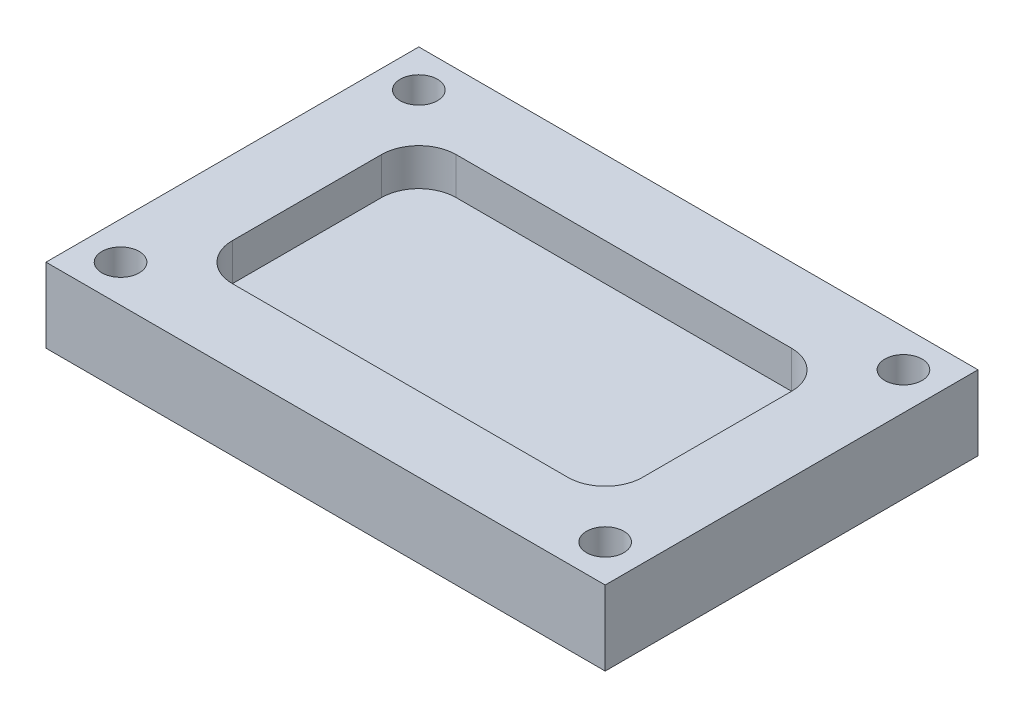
ISO-10303-21;
HEADER;
FILE_DESCRIPTION(('STEP AP214'),'2;1');
FILE_NAME('part.step','',(''),(''),'','','');
FILE_SCHEMA(('AUTOMOTIVE_DESIGN { 1 0 10303 214 1 1 1 1 }'));
ENDSEC;
DATA;
#1=APPLICATION_CONTEXT('core data for automotive mechanical design processes');
#2=APPLICATION_PROTOCOL_DEFINITION('international standard','automotive_design',2000,#1);
#3=PRODUCT_CONTEXT('',#1,'mechanical');
#4=PRODUCT('Part','Part','',(#3));
#5=PRODUCT_RELATED_PRODUCT_CATEGORY('part','',(#4));
#6=PRODUCT_DEFINITION_FORMATION('','',#4);
#7=PRODUCT_DEFINITION_CONTEXT('part definition',#1,'design');
#8=PRODUCT_DEFINITION('design','',#6,#7);
#9=PRODUCT_DEFINITION_SHAPE('','',#8);
#10=(LENGTH_UNIT() NAMED_UNIT(*) SI_UNIT(.MILLI.,.METRE.));
#11=(NAMED_UNIT(*) PLANE_ANGLE_UNIT() SI_UNIT($,.RADIAN.));
#12=(NAMED_UNIT(*) SI_UNIT($,.STERADIAN.) SOLID_ANGLE_UNIT());
#13=UNCERTAINTY_MEASURE_WITH_UNIT(LENGTH_MEASURE(1.E-05),#10,'distance_accuracy_value','');
#14=(GEOMETRIC_REPRESENTATION_CONTEXT(3) GLOBAL_UNCERTAINTY_ASSIGNED_CONTEXT((#13)) GLOBAL_UNIT_ASSIGNED_CONTEXT((#10,
#11,#12)) REPRESENTATION_CONTEXT('',''));
#15=CARTESIAN_POINT('',(0.,0.,0.));
#16=DIRECTION('',(0.,0.,1.));
#17=DIRECTION('',(1.,0.,0.));
#18=AXIS2_PLACEMENT_3D('',#15,#16,#17);
#19=CARTESIAN_POINT('',(75.,20.,50.));
#20=DIRECTION('',(-1.,0.,0.));
#21=DIRECTION('',(0.,0.,1.));
#22=AXIS2_PLACEMENT_3D('',#19,#20,#21);
#23=PLANE('',#22);
#24=DIRECTION('',(0.,0.,-1.));
#25=VECTOR('',#24,1.);
#26=CARTESIAN_POINT('',(75.,0.,50.));
#27=LINE('',#26,#25);
#28=CARTESIAN_POINT('',(75.,0.,50.));
#29=VERTEX_POINT('',#28);
#30=CARTESIAN_POINT('',(75.,0.,-50.));
#31=VERTEX_POINT('',#30);
#32=EDGE_CURVE('E300',#29,#31,#27,.T.);
#33=ORIENTED_EDGE('',*,*,#32,.T.);
#34=DIRECTION('',(0.,-1.,0.));
#35=VECTOR('',#34,1.);
#36=CARTESIAN_POINT('',(75.,20.,-50.));
#37=LINE('',#36,#35);
#38=CARTESIAN_POINT('',(75.,20.,-50.));
#39=VERTEX_POINT('',#38);
#40=EDGE_CURVE('E12',#39,#31,#37,.T.);
#41=ORIENTED_EDGE('',*,*,#40,.F.);
#42=DIRECTION('',(0.,0.,-1.));
#43=VECTOR('',#42,1.);
#44=CARTESIAN_POINT('',(75.,20.,50.));
#45=LINE('',#44,#43);
#46=CARTESIAN_POINT('',(75.,20.,50.));
#47=VERTEX_POINT('',#46);
#48=EDGE_CURVE('E304',#47,#39,#45,.T.);
#49=ORIENTED_EDGE('',*,*,#48,.F.);
#50=DIRECTION('',(0.,-1.,0.));
#51=VECTOR('',#50,1.);
#52=CARTESIAN_POINT('',(75.,20.,50.));
#53=LINE('',#52,#51);
#54=EDGE_CURVE('E322',#47,#29,#53,.T.);
#55=ORIENTED_EDGE('',*,*,#54,.T.);
#56=EDGE_LOOP('',(#33,#41,#49,#55));
#57=FACE_BOUND('',#56,.T.);
#58=ADVANCED_FACE('F47',(#57),#23,.F.);
#59=CARTESIAN_POINT('',(-75.,20.,-50.));
#60=DIRECTION('',(0.,0.,1.));
#61=DIRECTION('',(1.,0.,0.));
#62=AXIS2_PLACEMENT_3D('',#59,#60,#61);
#63=PLANE('',#62);
#64=DIRECTION('',(-1.,0.,0.));
#65=VECTOR('',#64,1.);
#66=CARTESIAN_POINT('',(-75.,0.,-50.));
#67=LINE('',#66,#65);
#68=CARTESIAN_POINT('',(-75.,0.,-50.));
#69=VERTEX_POINT('',#68);
#70=EDGE_CURVE('E326',#31,#69,#67,.T.);
#71=ORIENTED_EDGE('',*,*,#70,.T.);
#72=DIRECTION('',(0.,-1.,0.));
#73=VECTOR('',#72,1.);
#74=CARTESIAN_POINT('',(-75.,20.,-50.));
#75=LINE('',#74,#73);
#76=CARTESIAN_POINT('',(-75.,20.,-50.));
#77=VERTEX_POINT('',#76);
#78=EDGE_CURVE('E55',#77,#69,#75,.T.);
#79=ORIENTED_EDGE('',*,*,#78,.F.);
#80=DIRECTION('',(-1.,0.,0.));
#81=VECTOR('',#80,1.);
#82=CARTESIAN_POINT('',(-75.,20.,-50.));
#83=LINE('',#82,#81);
#84=EDGE_CURVE('E99',#39,#77,#83,.T.);
#85=ORIENTED_EDGE('',*,*,#84,.F.);
#86=ORIENTED_EDGE('',*,*,#40,.T.);
#87=EDGE_LOOP('',(#71,#79,#85,#86));
#88=FACE_BOUND('',#87,.T.);
#89=ADVANCED_FACE('F361',(#88),#63,.F.);
#90=CARTESIAN_POINT('',(-75.,20.,50.));
#91=DIRECTION('',(1.,0.,0.));
#92=DIRECTION('',(0.,0.,-1.));
#93=AXIS2_PLACEMENT_3D('',#90,#91,#92);
#94=PLANE('',#93);
#95=DIRECTION('',(0.,0.,1.));
#96=VECTOR('',#95,1.);
#97=CARTESIAN_POINT('',(-75.,0.,50.));
#98=LINE('',#97,#96);
#99=CARTESIAN_POINT('',(-75.,0.,50.));
#100=VERTEX_POINT('',#99);
#101=EDGE_CURVE('E329',#69,#100,#98,.T.);
#102=ORIENTED_EDGE('',*,*,#101,.T.);
#103=DIRECTION('',(0.,-1.,0.));
#104=VECTOR('',#103,1.);
#105=CARTESIAN_POINT('',(-75.,20.,50.));
#106=LINE('',#105,#104);
#107=CARTESIAN_POINT('',(-75.,20.,50.));
#108=VERTEX_POINT('',#107);
#109=EDGE_CURVE('E336',#108,#100,#106,.T.);
#110=ORIENTED_EDGE('',*,*,#109,.F.);
#111=DIRECTION('',(0.,0.,1.));
#112=VECTOR('',#111,1.);
#113=CARTESIAN_POINT('',(-75.,20.,50.));
#114=LINE('',#113,#112);
#115=EDGE_CURVE('E316',#77,#108,#114,.T.);
#116=ORIENTED_EDGE('',*,*,#115,.F.);
#117=ORIENTED_EDGE('',*,*,#78,.T.);
#118=EDGE_LOOP('',(#102,#110,#116,#117));
#119=FACE_BOUND('',#118,.T.);
#120=ADVANCED_FACE('F343',(#119),#94,.F.);
#121=CARTESIAN_POINT('',(-75.,20.,50.));
#122=DIRECTION('',(0.,0.,-1.));
#123=DIRECTION('',(-1.,0.,0.));
#124=AXIS2_PLACEMENT_3D('',#121,#122,#123);
#125=PLANE('',#124);
#126=DIRECTION('',(1.,0.,0.));
#127=VECTOR('',#126,1.);
#128=CARTESIAN_POINT('',(-75.,0.,50.));
#129=LINE('',#128,#127);
#130=EDGE_CURVE('E92',#100,#29,#129,.T.);
#131=ORIENTED_EDGE('',*,*,#130,.T.);
#132=ORIENTED_EDGE('',*,*,#54,.F.);
#133=DIRECTION('',(1.,0.,0.));
#134=VECTOR('',#133,1.);
#135=CARTESIAN_POINT('',(-75.,20.,50.));
#136=LINE('',#135,#134);
#137=EDGE_CURVE('E71',#108,#47,#136,.T.);
#138=ORIENTED_EDGE('',*,*,#137,.F.);
#139=ORIENTED_EDGE('',*,*,#109,.T.);
#140=EDGE_LOOP('',(#131,#132,#138,#139));
#141=FACE_BOUND('',#140,.T.);
#142=ADVANCED_FACE('F351',(#141),#125,.F.);
#143=CARTESIAN_POINT('',(0.,20.,0.));
#144=DIRECTION('',(0.,-1.,0.));
#145=DIRECTION('',(0.,0.,-1.));
#146=AXIS2_PLACEMENT_3D('',#143,#144,#145);
#147=PLANE('',#146);
#148=DIRECTION('',(0.,0.,-1.));
#149=VECTOR('',#148,1.);
#150=CARTESIAN_POINT('',(55.,20.,19.9999999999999));
#151=LINE('',#150,#149);
#152=CARTESIAN_POINT('',(55.,20.,19.9999999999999));
#153=VERTEX_POINT('',#152);
#154=CARTESIAN_POINT('',(55.,20.,-19.9999999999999));
#155=VERTEX_POINT('',#154);
#156=EDGE_CURVE('E228',#153,#155,#151,.T.);
#157=ORIENTED_EDGE('',*,*,#156,.F.);
#158=CARTESIAN_POINT('',(45.,20.,20.));
#159=DIRECTION('',(0.,1.,0.));
#160=DIRECTION('',(0.,0.,-1.));
#161=AXIS2_PLACEMENT_3D('',#158,#159,#160);
#162=CIRCLE('',#161,10.);
#163=CARTESIAN_POINT('',(44.9999999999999,20.,30.));
#164=VERTEX_POINT('',#163);
#165=EDGE_CURVE('E62',#164,#153,#162,.T.);
#166=ORIENTED_EDGE('',*,*,#165,.F.);
#167=DIRECTION('',(1.,0.,0.));
#168=VECTOR('',#167,1.);
#169=CARTESIAN_POINT('',(-44.9999999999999,20.,30.));
#170=LINE('',#169,#168);
#171=CARTESIAN_POINT('',(-44.9999999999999,20.,30.));
#172=VERTEX_POINT('',#171);
#173=EDGE_CURVE('E182',#172,#164,#170,.T.);
#174=ORIENTED_EDGE('',*,*,#173,.F.);
#175=CARTESIAN_POINT('',(-45.,20.,20.));
#176=DIRECTION('',(0.,1.,0.));
#177=DIRECTION('',(0.,0.,-1.));
#178=AXIS2_PLACEMENT_3D('',#175,#176,#177);
#179=CIRCLE('',#178,10.);
#180=CARTESIAN_POINT('',(-55.,20.,19.9999999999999));
#181=VERTEX_POINT('',#180);
#182=EDGE_CURVE('E186',#181,#172,#179,.T.);
#183=ORIENTED_EDGE('',*,*,#182,.F.);
#184=DIRECTION('',(0.,0.,1.));
#185=VECTOR('',#184,1.);
#186=CARTESIAN_POINT('',(-55.,20.,-19.9999999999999));
#187=LINE('',#186,#185);
#188=CARTESIAN_POINT('',(-55.,20.,-19.9999999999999));
#189=VERTEX_POINT('',#188);
#190=EDGE_CURVE('E245',#189,#181,#187,.T.);
#191=ORIENTED_EDGE('',*,*,#190,.F.);
#192=CARTESIAN_POINT('',(-45.,20.,-20.));
#193=DIRECTION('',(0.,1.,0.));
#194=DIRECTION('',(0.,0.,1.));
#195=AXIS2_PLACEMENT_3D('',#192,#193,#194);
#196=CIRCLE('',#195,10.);
#197=CARTESIAN_POINT('',(-44.9999999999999,20.,-30.));
#198=VERTEX_POINT('',#197);
#199=EDGE_CURVE('E239',#198,#189,#196,.T.);
#200=ORIENTED_EDGE('',*,*,#199,.F.);
#201=DIRECTION('',(-1.,0.,0.));
#202=VECTOR('',#201,1.);
#203=CARTESIAN_POINT('',(44.9999999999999,20.,-30.));
#204=LINE('',#203,#202);
#205=CARTESIAN_POINT('',(44.9999999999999,20.,-30.));
#206=VERTEX_POINT('',#205);
#207=EDGE_CURVE('E246',#206,#198,#204,.T.);
#208=ORIENTED_EDGE('',*,*,#207,.F.);
#209=CARTESIAN_POINT('',(45.,20.,-20.));
#210=DIRECTION('',(0.,1.,0.));
#211=DIRECTION('',(0.,0.,1.));
#212=AXIS2_PLACEMENT_3D('',#209,#210,#211);
#213=CIRCLE('',#212,10.);
#214=EDGE_CURVE('E625',#155,#206,#213,.T.);
#215=ORIENTED_EDGE('',*,*,#214,.F.);
#216=EDGE_LOOP('',(#157,#166,#174,#183,#191,#200,#208,#215));
#217=FACE_BOUND('',#216,.T.);
#218=CARTESIAN_POINT('',(-65.,20.,-40.));
#219=DIRECTION('',(0.,1.,0.));
#220=DIRECTION('',(0.,0.,1.));
#221=AXIS2_PLACEMENT_3D('',#218,#219,#220);
#222=CIRCLE('',#221,4.99999999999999);
#223=CARTESIAN_POINT('',(-65.,20.,-35.));
#224=VERTEX_POINT('',#223);
#225=EDGE_CURVE('E261',#224,#224,#222,.T.);
#226=ORIENTED_EDGE('',*,*,#225,.F.);
#227=EDGE_LOOP('',(#226));
#228=FACE_BOUND('',#227,.T.);
#229=CARTESIAN_POINT('',(-65.,20.,40.));
#230=DIRECTION('',(0.,1.,0.));
#231=DIRECTION('',(0.,0.,1.));
#232=AXIS2_PLACEMENT_3D('',#229,#230,#231);
#233=CIRCLE('',#232,4.99999999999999);
#234=CARTESIAN_POINT('',(-65.,20.,45.));
#235=VERTEX_POINT('',#234);
#236=EDGE_CURVE('E280',#235,#235,#233,.T.);
#237=ORIENTED_EDGE('',*,*,#236,.F.);
#238=EDGE_LOOP('',(#237));
#239=FACE_BOUND('',#238,.T.);
#240=CARTESIAN_POINT('',(65.,20.,40.));
#241=DIRECTION('',(0.,1.,0.));
#242=DIRECTION('',(0.,0.,1.));
#243=AXIS2_PLACEMENT_3D('',#240,#241,#242);
#244=CIRCLE('',#243,4.99999999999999);
#245=CARTESIAN_POINT('',(65.,20.,45.));
#246=VERTEX_POINT('',#245);
#247=EDGE_CURVE('E670',#246,#246,#244,.T.);
#248=ORIENTED_EDGE('',*,*,#247,.F.);
#249=EDGE_LOOP('',(#248));
#250=FACE_BOUND('',#249,.T.);
#251=CARTESIAN_POINT('',(65.,20.,-40.));
#252=DIRECTION('',(0.,1.,0.));
#253=DIRECTION('',(0.,0.,1.));
#254=AXIS2_PLACEMENT_3D('',#251,#252,#253);
#255=CIRCLE('',#254,4.99999999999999);
#256=CARTESIAN_POINT('',(65.,20.,-35.));
#257=VERTEX_POINT('',#256);
#258=EDGE_CURVE('E301',#257,#257,#255,.T.);
#259=ORIENTED_EDGE('',*,*,#258,.F.);
#260=EDGE_LOOP('',(#259));
#261=FACE_BOUND('',#260,.T.);
#262=ORIENTED_EDGE('',*,*,#48,.T.);
#263=ORIENTED_EDGE('',*,*,#84,.T.);
#264=ORIENTED_EDGE('',*,*,#115,.T.);
#265=ORIENTED_EDGE('',*,*,#137,.T.);
#266=EDGE_LOOP('',(#262,#263,#264,#265));
#267=FACE_BOUND('',#266,.T.);
#268=ADVANCED_FACE('F353',(#217,#228,#239,#250,#261,#267),#147,.F.);
#269=CARTESIAN_POINT('',(0.,0.,0.));
#270=DIRECTION('',(0.,-1.,0.));
#271=DIRECTION('',(0.,0.,-1.));
#272=AXIS2_PLACEMENT_3D('',#269,#270,#271);
#273=PLANE('',#272);
#274=ORIENTED_EDGE('',*,*,#32,.F.);
#275=ORIENTED_EDGE('',*,*,#130,.F.);
#276=ORIENTED_EDGE('',*,*,#101,.F.);
#277=ORIENTED_EDGE('',*,*,#70,.F.);
#278=EDGE_LOOP('',(#274,#275,#276,#277));
#279=FACE_BOUND('',#278,.T.);
#280=ADVANCED_FACE('F347',(#279),#273,.T.);
#281=CARTESIAN_POINT('',(65.,10.,-40.));
#282=DIRECTION('',(0.,1.,0.));
#283=DIRECTION('',(0.,0.,1.));
#284=AXIS2_PLACEMENT_3D('',#281,#282,#283);
#285=CONICAL_SURFACE('',#284,5.,1.02974425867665);
#286=CARTESIAN_POINT('',(65.,6.9956969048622,-40.));
#287=VERTEX_POINT('',#286);
#288=VERTEX_LOOP('',#287);
#289=FACE_BOUND('',#288,.T.);
#290=CARTESIAN_POINT('',(65.,10.,-40.));
#291=DIRECTION('',(0.,1.,0.));
#292=DIRECTION('',(0.,0.,1.));
#293=AXIS2_PLACEMENT_3D('',#290,#291,#292);
#294=CIRCLE('',#293,5.);
#295=CARTESIAN_POINT('',(65.,10.,-35.));
#296=VERTEX_POINT('',#295);
#297=EDGE_CURVE('E295',#296,#296,#294,.T.);
#298=ORIENTED_EDGE('',*,*,#297,.T.);
#299=EDGE_LOOP('',(#298));
#300=FACE_BOUND('',#299,.T.);
#301=ADVANCED_FACE('F393',(#289,#300),#285,.F.);
#302=CARTESIAN_POINT('',(65.,20.,-40.));
#303=DIRECTION('',(0.,1.,0.));
#304=DIRECTION('',(0.,0.,1.));
#305=AXIS2_PLACEMENT_3D('',#302,#303,#304);
#306=CYLINDRICAL_SURFACE('',#305,5.);
#307=ORIENTED_EDGE('',*,*,#297,.F.);
#308=EDGE_LOOP('',(#307));
#309=FACE_BOUND('',#308,.T.);
#310=ORIENTED_EDGE('',*,*,#258,.T.);
#311=EDGE_LOOP('',(#310));
#312=FACE_BOUND('',#311,.T.);
#313=ADVANCED_FACE('F400',(#309,#312),#306,.F.);
#314=CARTESIAN_POINT('',(65.,10.,40.));
#315=DIRECTION('',(0.,1.,0.));
#316=DIRECTION('',(0.,0.,1.));
#317=AXIS2_PLACEMENT_3D('',#314,#315,#316);
#318=CONICAL_SURFACE('',#317,5.,1.02974425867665);
#319=CARTESIAN_POINT('',(65.,6.9956969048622,40.));
#320=VERTEX_POINT('',#319);
#321=VERTEX_LOOP('',#320);
#322=FACE_BOUND('',#321,.T.);
#323=CARTESIAN_POINT('',(65.,10.,40.));
#324=DIRECTION('',(0.,1.,0.));
#325=DIRECTION('',(0.,0.,1.));
#326=AXIS2_PLACEMENT_3D('',#323,#324,#325);
#327=CIRCLE('',#326,5.);
#328=CARTESIAN_POINT('',(65.,10.,45.));
#329=VERTEX_POINT('',#328);
#330=EDGE_CURVE('E673',#329,#329,#327,.T.);
#331=ORIENTED_EDGE('',*,*,#330,.T.);
#332=EDGE_LOOP('',(#331));
#333=FACE_BOUND('',#332,.T.);
#334=ADVANCED_FACE('F409',(#322,#333),#318,.F.);
#335=CARTESIAN_POINT('',(65.,20.,40.));
#336=DIRECTION('',(0.,1.,0.));
#337=DIRECTION('',(0.,0.,1.));
#338=AXIS2_PLACEMENT_3D('',#335,#336,#337);
#339=CYLINDRICAL_SURFACE('',#338,5.);
#340=ORIENTED_EDGE('',*,*,#330,.F.);
#341=EDGE_LOOP('',(#340));
#342=FACE_BOUND('',#341,.T.);
#343=ORIENTED_EDGE('',*,*,#247,.T.);
#344=EDGE_LOOP('',(#343));
#345=FACE_BOUND('',#344,.T.);
#346=ADVANCED_FACE('F419',(#342,#345),#339,.F.);
#347=CARTESIAN_POINT('',(-65.,10.,40.));
#348=DIRECTION('',(0.,1.,0.));
#349=DIRECTION('',(0.,0.,1.));
#350=AXIS2_PLACEMENT_3D('',#347,#348,#349);
#351=CONICAL_SURFACE('',#350,5.,1.02974425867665);
#352=CARTESIAN_POINT('',(-65.,6.9956969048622,40.));
#353=VERTEX_POINT('',#352);
#354=VERTEX_LOOP('',#353);
#355=FACE_BOUND('',#354,.T.);
#356=CARTESIAN_POINT('',(-65.,10.,40.));
#357=DIRECTION('',(0.,1.,0.));
#358=DIRECTION('',(0.,0.,1.));
#359=AXIS2_PLACEMENT_3D('',#356,#357,#358);
#360=CIRCLE('',#359,5.);
#361=CARTESIAN_POINT('',(-65.,10.,45.));
#362=VERTEX_POINT('',#361);
#363=EDGE_CURVE('E286',#362,#362,#360,.T.);
#364=ORIENTED_EDGE('',*,*,#363,.T.);
#365=EDGE_LOOP('',(#364));
#366=FACE_BOUND('',#365,.T.);
#367=ADVANCED_FACE('F429',(#355,#366),#351,.F.);
#368=CARTESIAN_POINT('',(-65.,20.,40.));
#369=DIRECTION('',(0.,1.,0.));
#370=DIRECTION('',(0.,0.,1.));
#371=AXIS2_PLACEMENT_3D('',#368,#369,#370);
#372=CYLINDRICAL_SURFACE('',#371,4.99999999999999);
#373=ORIENTED_EDGE('',*,*,#363,.F.);
#374=EDGE_LOOP('',(#373));
#375=FACE_BOUND('',#374,.T.);
#376=ORIENTED_EDGE('',*,*,#236,.T.);
#377=EDGE_LOOP('',(#376));
#378=FACE_BOUND('',#377,.T.);
#379=ADVANCED_FACE('F439',(#375,#378),#372,.F.);
#380=CARTESIAN_POINT('',(-65.,10.,-40.));
#381=DIRECTION('',(0.,1.,0.));
#382=DIRECTION('',(0.,0.,1.));
#383=AXIS2_PLACEMENT_3D('',#380,#381,#382);
#384=CONICAL_SURFACE('',#383,5.,1.02974425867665);
#385=CARTESIAN_POINT('',(-65.,6.9956969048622,-40.));
#386=VERTEX_POINT('',#385);
#387=VERTEX_LOOP('',#386);
#388=FACE_BOUND('',#387,.T.);
#389=CARTESIAN_POINT('',(-65.,10.,-40.));
#390=DIRECTION('',(0.,1.,0.));
#391=DIRECTION('',(0.,0.,1.));
#392=AXIS2_PLACEMENT_3D('',#389,#390,#391);
#393=CIRCLE('',#392,5.);
#394=CARTESIAN_POINT('',(-65.,10.,-35.));
#395=VERTEX_POINT('',#394);
#396=EDGE_CURVE('E275',#395,#395,#393,.T.);
#397=ORIENTED_EDGE('',*,*,#396,.T.);
#398=EDGE_LOOP('',(#397));
#399=FACE_BOUND('',#398,.T.);
#400=ADVANCED_FACE('F449',(#388,#399),#384,.F.);
#401=CARTESIAN_POINT('',(-65.,20.,-40.));
#402=DIRECTION('',(0.,1.,0.));
#403=DIRECTION('',(0.,0.,1.));
#404=AXIS2_PLACEMENT_3D('',#401,#402,#403);
#405=CYLINDRICAL_SURFACE('',#404,4.99999999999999);
#406=ORIENTED_EDGE('',*,*,#396,.F.);
#407=EDGE_LOOP('',(#406));
#408=FACE_BOUND('',#407,.T.);
#409=ORIENTED_EDGE('',*,*,#225,.T.);
#410=EDGE_LOOP('',(#409));
#411=FACE_BOUND('',#410,.T.);
#412=ADVANCED_FACE('F459',(#408,#411),#405,.F.);
#413=CARTESIAN_POINT('',(45.,10.,20.));
#414=DIRECTION('',(0.,1.,0.));
#415=DIRECTION('',(0.,0.,1.));
#416=AXIS2_PLACEMENT_3D('',#413,#414,#415);
#417=CYLINDRICAL_SURFACE('',#416,10.);
#418=ORIENTED_EDGE('',*,*,#165,.T.);
#419=DIRECTION('',(0.,1.,0.));
#420=VECTOR('',#419,1.);
#421=CARTESIAN_POINT('',(55.,10.,19.9999999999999));
#422=LINE('',#421,#420);
#423=CARTESIAN_POINT('',(55.,10.,19.9999999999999));
#424=VERTEX_POINT('',#423);
#425=EDGE_CURVE('E155',#424,#153,#422,.T.);
#426=ORIENTED_EDGE('',*,*,#425,.F.);
#427=CARTESIAN_POINT('',(45.,10.,20.));
#428=DIRECTION('',(0.,1.,0.));
#429=DIRECTION('',(0.,0.,-1.));
#430=AXIS2_PLACEMENT_3D('',#427,#428,#429);
#431=CIRCLE('',#430,10.);
#432=CARTESIAN_POINT('',(44.9999999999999,10.,30.));
#433=VERTEX_POINT('',#432);
#434=EDGE_CURVE('E159',#433,#424,#431,.T.);
#435=ORIENTED_EDGE('',*,*,#434,.F.);
#436=DIRECTION('',(0.,1.,0.));
#437=VECTOR('',#436,1.);
#438=CARTESIAN_POINT('',(44.9999999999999,10.,30.));
#439=LINE('',#438,#437);
#440=EDGE_CURVE('E257',#433,#164,#439,.T.);
#441=ORIENTED_EDGE('',*,*,#440,.T.);
#442=EDGE_LOOP('',(#418,#426,#435,#441));
#443=FACE_BOUND('',#442,.T.);
#444=ADVANCED_FACE('F157',(#443),#417,.F.);
#445=CARTESIAN_POINT('',(-44.9999999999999,10.,30.));
#446=DIRECTION('',(0.,0.,1.));
#447=DIRECTION('',(1.,0.,0.));
#448=AXIS2_PLACEMENT_3D('',#445,#446,#447);
#449=PLANE('',#448);
#450=ORIENTED_EDGE('',*,*,#173,.T.);
#451=ORIENTED_EDGE('',*,*,#440,.F.);
#452=DIRECTION('',(1.,0.,0.));
#453=VECTOR('',#452,1.);
#454=CARTESIAN_POINT('',(-44.9999999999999,10.,30.));
#455=LINE('',#454,#453);
#456=CARTESIAN_POINT('',(-44.9999999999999,10.,30.));
#457=VERTEX_POINT('',#456);
#458=EDGE_CURVE('E166',#457,#433,#455,.T.);
#459=ORIENTED_EDGE('',*,*,#458,.F.);
#460=DIRECTION('',(0.,1.,0.));
#461=VECTOR('',#460,1.);
#462=CARTESIAN_POINT('',(-44.9999999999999,10.,30.));
#463=LINE('',#462,#461);
#464=EDGE_CURVE('E262',#457,#172,#463,.T.);
#465=ORIENTED_EDGE('',*,*,#464,.T.);
#466=EDGE_LOOP('',(#450,#451,#459,#465));
#467=FACE_BOUND('',#466,.T.);
#468=ADVANCED_FACE('F477',(#467),#449,.F.);
#469=CARTESIAN_POINT('',(-45.,10.,20.));
#470=DIRECTION('',(0.,1.,0.));
#471=DIRECTION('',(0.,0.,1.));
#472=AXIS2_PLACEMENT_3D('',#469,#470,#471);
#473=CYLINDRICAL_SURFACE('',#472,10.);
#474=ORIENTED_EDGE('',*,*,#182,.T.);
#475=ORIENTED_EDGE('',*,*,#464,.F.);
#476=CARTESIAN_POINT('',(-45.,10.,20.));
#477=DIRECTION('',(0.,1.,0.));
#478=DIRECTION('',(0.,0.,-1.));
#479=AXIS2_PLACEMENT_3D('',#476,#477,#478);
#480=CIRCLE('',#479,10.);
#481=CARTESIAN_POINT('',(-55.,10.,19.9999999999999));
#482=VERTEX_POINT('',#481);
#483=EDGE_CURVE('E219',#482,#457,#480,.T.);
#484=ORIENTED_EDGE('',*,*,#483,.F.);
#485=DIRECTION('',(0.,1.,0.));
#486=VECTOR('',#485,1.);
#487=CARTESIAN_POINT('',(-55.,10.,19.9999999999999));
#488=LINE('',#487,#486);
#489=EDGE_CURVE('E641',#482,#181,#488,.T.);
#490=ORIENTED_EDGE('',*,*,#489,.T.);
#491=EDGE_LOOP('',(#474,#475,#484,#490));
#492=FACE_BOUND('',#491,.T.);
#493=ADVANCED_FACE('F488',(#492),#473,.F.);
#494=CARTESIAN_POINT('',(-55.,10.,-19.9999999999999));
#495=DIRECTION('',(-1.,0.,0.));
#496=DIRECTION('',(0.,0.,1.));
#497=AXIS2_PLACEMENT_3D('',#494,#495,#496);
#498=PLANE('',#497);
#499=ORIENTED_EDGE('',*,*,#190,.T.);
#500=ORIENTED_EDGE('',*,*,#489,.F.);
#501=DIRECTION('',(0.,0.,1.));
#502=VECTOR('',#501,1.);
#503=CARTESIAN_POINT('',(-55.,10.,-19.9999999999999));
#504=LINE('',#503,#502);
#505=CARTESIAN_POINT('',(-55.,10.,-19.9999999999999));
#506=VERTEX_POINT('',#505);
#507=EDGE_CURVE('E211',#506,#482,#504,.T.);
#508=ORIENTED_EDGE('',*,*,#507,.F.);
#509=DIRECTION('',(0.,1.,0.));
#510=VECTOR('',#509,1.);
#511=CARTESIAN_POINT('',(-55.,10.,-19.9999999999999));
#512=LINE('',#511,#510);
#513=EDGE_CURVE('E645',#506,#189,#512,.T.);
#514=ORIENTED_EDGE('',*,*,#513,.T.);
#515=EDGE_LOOP('',(#499,#500,#508,#514));
#516=FACE_BOUND('',#515,.T.);
#517=ADVANCED_FACE('F499',(#516),#498,.F.);
#518=CARTESIAN_POINT('',(-45.,10.,-20.));
#519=DIRECTION('',(0.,1.,0.));
#520=DIRECTION('',(0.,0.,1.));
#521=AXIS2_PLACEMENT_3D('',#518,#519,#520);
#522=CYLINDRICAL_SURFACE('',#521,10.);
#523=ORIENTED_EDGE('',*,*,#199,.T.);
#524=ORIENTED_EDGE('',*,*,#513,.F.);
#525=CARTESIAN_POINT('',(-45.,10.,-20.));
#526=DIRECTION('',(0.,1.,0.));
#527=DIRECTION('',(0.,0.,1.));
#528=AXIS2_PLACEMENT_3D('',#525,#526,#527);
#529=CIRCLE('',#528,10.);
#530=CARTESIAN_POINT('',(-44.9999999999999,10.,-30.));
#531=VERTEX_POINT('',#530);
#532=EDGE_CURVE('E206',#531,#506,#529,.T.);
#533=ORIENTED_EDGE('',*,*,#532,.F.);
#534=DIRECTION('',(0.,1.,0.));
#535=VECTOR('',#534,1.);
#536=CARTESIAN_POINT('',(-44.9999999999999,10.,-30.));
#537=LINE('',#536,#535);
#538=EDGE_CURVE('E648',#531,#198,#537,.T.);
#539=ORIENTED_EDGE('',*,*,#538,.T.);
#540=EDGE_LOOP('',(#523,#524,#533,#539));
#541=FACE_BOUND('',#540,.T.);
#542=ADVANCED_FACE('F508',(#541),#522,.F.);
#543=CARTESIAN_POINT('',(44.9999999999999,10.,-30.));
#544=DIRECTION('',(0.,0.,-1.));
#545=DIRECTION('',(-1.,0.,0.));
#546=AXIS2_PLACEMENT_3D('',#543,#544,#545);
#547=PLANE('',#546);
#548=ORIENTED_EDGE('',*,*,#207,.T.);
#549=ORIENTED_EDGE('',*,*,#538,.F.);
#550=DIRECTION('',(-1.,0.,0.));
#551=VECTOR('',#550,1.);
#552=CARTESIAN_POINT('',(44.9999999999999,10.,-30.));
#553=LINE('',#552,#551);
#554=CARTESIAN_POINT('',(44.9999999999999,10.,-30.));
#555=VERTEX_POINT('',#554);
#556=EDGE_CURVE('E201',#555,#531,#553,.T.);
#557=ORIENTED_EDGE('',*,*,#556,.F.);
#558=DIRECTION('',(0.,1.,0.));
#559=VECTOR('',#558,1.);
#560=CARTESIAN_POINT('',(44.9999999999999,10.,-30.));
#561=LINE('',#560,#559);
#562=EDGE_CURVE('E627',#555,#206,#561,.T.);
#563=ORIENTED_EDGE('',*,*,#562,.T.);
#564=EDGE_LOOP('',(#548,#549,#557,#563));
#565=FACE_BOUND('',#564,.T.);
#566=ADVANCED_FACE('F518',(#565),#547,.F.);
#567=CARTESIAN_POINT('',(45.,10.,-20.));
#568=DIRECTION('',(0.,1.,0.));
#569=DIRECTION('',(0.,0.,1.));
#570=AXIS2_PLACEMENT_3D('',#567,#568,#569);
#571=CYLINDRICAL_SURFACE('',#570,10.);
#572=ORIENTED_EDGE('',*,*,#214,.T.);
#573=ORIENTED_EDGE('',*,*,#562,.F.);
#574=CARTESIAN_POINT('',(45.,10.,-20.));
#575=DIRECTION('',(0.,1.,0.));
#576=DIRECTION('',(0.,0.,1.));
#577=AXIS2_PLACEMENT_3D('',#574,#575,#576);
#578=CIRCLE('',#577,10.);
#579=CARTESIAN_POINT('',(55.,10.,-19.9999999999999));
#580=VERTEX_POINT('',#579);
#581=EDGE_CURVE('E175',#580,#555,#578,.T.);
#582=ORIENTED_EDGE('',*,*,#581,.F.);
#583=DIRECTION('',(0.,1.,0.));
#584=VECTOR('',#583,1.);
#585=CARTESIAN_POINT('',(55.,10.,-19.9999999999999));
#586=LINE('',#585,#584);
#587=EDGE_CURVE('E165',#580,#155,#586,.T.);
#588=ORIENTED_EDGE('',*,*,#587,.T.);
#589=EDGE_LOOP('',(#572,#573,#582,#588));
#590=FACE_BOUND('',#589,.T.);
#591=ADVANCED_FACE('F527',(#590),#571,.F.);
#592=CARTESIAN_POINT('',(55.,10.,19.9999999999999));
#593=DIRECTION('',(1.,0.,0.));
#594=DIRECTION('',(0.,0.,-1.));
#595=AXIS2_PLACEMENT_3D('',#592,#593,#594);
#596=PLANE('',#595);
#597=ORIENTED_EDGE('',*,*,#156,.T.);
#598=ORIENTED_EDGE('',*,*,#587,.F.);
#599=DIRECTION('',(0.,0.,-1.));
#600=VECTOR('',#599,1.);
#601=CARTESIAN_POINT('',(55.,10.,19.9999999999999));
#602=LINE('',#601,#600);
#603=EDGE_CURVE('E169',#424,#580,#602,.T.);
#604=ORIENTED_EDGE('',*,*,#603,.F.);
#605=ORIENTED_EDGE('',*,*,#425,.T.);
#606=EDGE_LOOP('',(#597,#598,#604,#605));
#607=FACE_BOUND('',#606,.T.);
#608=ADVANCED_FACE('F170',(#607),#596,.F.);
#609=CARTESIAN_POINT('',(45.,10.,20.));
#610=DIRECTION('',(0.,-1.,0.));
#611=DIRECTION('',(0.,0.,-1.));
#612=AXIS2_PLACEMENT_3D('',#609,#610,#611);
#613=PLANE('',#612);
#614=ORIENTED_EDGE('',*,*,#434,.T.);
#615=ORIENTED_EDGE('',*,*,#603,.T.);
#616=ORIENTED_EDGE('',*,*,#581,.T.);
#617=ORIENTED_EDGE('',*,*,#556,.T.);
#618=ORIENTED_EDGE('',*,*,#532,.T.);
#619=ORIENTED_EDGE('',*,*,#507,.T.);
#620=ORIENTED_EDGE('',*,*,#483,.T.);
#621=ORIENTED_EDGE('',*,*,#458,.T.);
#622=EDGE_LOOP('',(#614,#615,#616,#617,#618,#619,#620,#621));
#623=FACE_BOUND('',#622,.T.);
#624=ADVANCED_FACE('F178',(#623),#613,.F.);
#625=CLOSED_SHELL('',(#58,#89,#120,#142,#268,#280,#301,#313,#334,#346,#367,#379,#400,#412,#444,
#468,#493,#517,#542,#566,#591,#608,#624));
#626=MANIFOLD_SOLID_BREP('B2',#625);
#627=ADVANCED_BREP_SHAPE_REPRESENTATION('',(#18,#626),#14);
#628=SHAPE_DEFINITION_REPRESENTATION(#9,#627);
ENDSEC;
END-ISO-10303-21;
